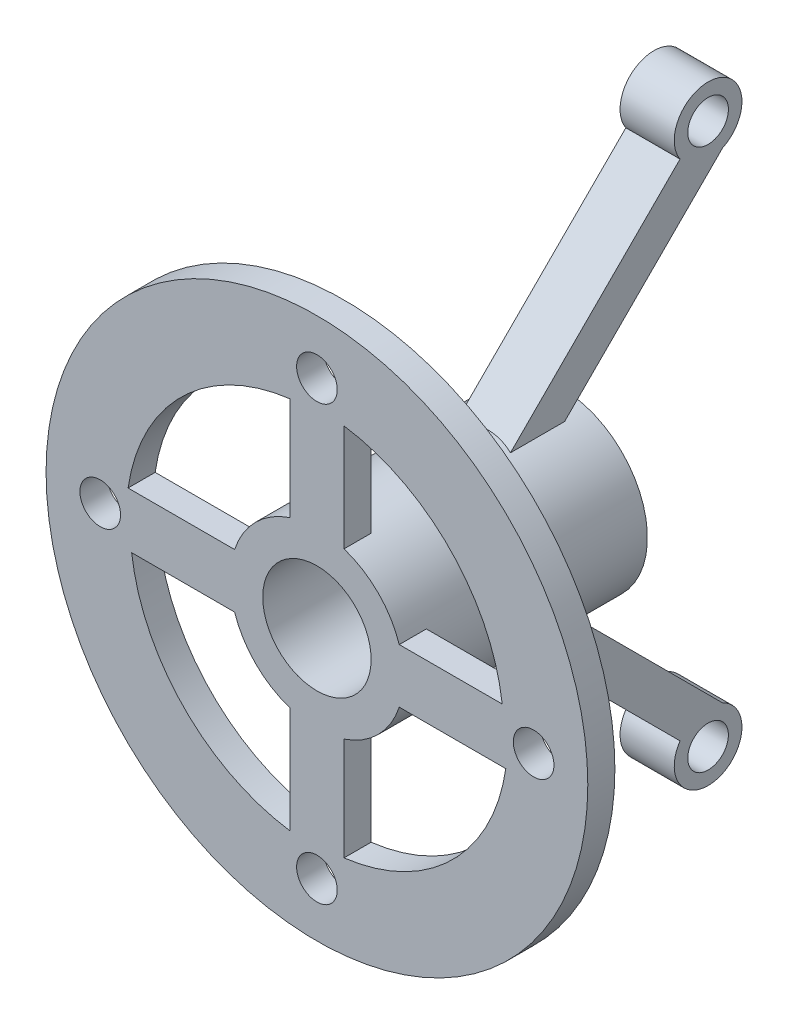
from build123d import *

# Parameters (mm, degrees)
SKETCH2_R           = 63.5
BOSS_EXTRUDE1_DEPTH = 3.175
CUT_EXTRUDE1_REACH  = 92.027
SKETCH3_R           = 4.7625
CIRPATTERN1_COUNT   = 4
CUT_EXTRUDE2_REACH  = 92.027
SKETCH5_R           = 12.7
BOSS_EXTRUDE2_START = 50.8
SKETCH6_R           = 20.32
SKETCH6_R_2         = 12.7
BOSS_EXTRUDE2_DEPTH = 50.8
BOSS_EXTRUDE3_DEPTH = 6.35
SKETCH8_R           = 7.9375
BOSS_EXTRUDE4_DEPTH = 6.35
CUT_EXTRUDE3_REACH  = 136.545
SKETCH9_R           = 4.7625


with BuildPart() as part:
    # Sketch2 → Boss-Extrude1 (new, symmetric)
    with BuildSketch(Plane.XY):
        Circle(SKETCH2_R)
    extrude(amount=BOSS_EXTRUDE1_DEPTH, both=True)

    # Sketch3 → Cut-Extrude1 (cut, up to next)
    with BuildSketch(Plane.XY.offset(3.175), mode=Mode.PRIVATE) as cut_extrude1_sk1:
        with Locations((0, 50.8)):
            Circle(SKETCH3_R)
    cut_extrude1_tool1 = extrude(cut_extrude1_sk1.sketch, amount=-CUT_EXTRUDE1_REACH, mode=Mode.PRIVATE) & part.part
    cut_extrude1 = cut_extrude1_tool1.solids().sort_by_distance((0, 50.8, 3.175))[0]
    add(cut_extrude1, mode=Mode.SUBTRACT)

    # CirPattern1: Cut-Extrude1 ×4 about axis
    cirpattern1_axis = Axis((0, 0, 0), (0, 0, 1))
    for i in range(1, CIRPATTERN1_COUNT):
        add(cut_extrude1.rotate(cirpattern1_axis, i * 360 / CIRPATTERN1_COUNT), mode=Mode.SUBTRACT)

    # Sketch5 → Cut-Extrude2 (cut, up to next)
    with BuildSketch(Plane(origin=(0, 0, -3.175), x_dir=(-1, 0, 0), z_dir=(0, 0, -1)), mode=Mode.PRIVATE) as cut_extrude2_sk1:
        Circle(SKETCH5_R)
    cut_extrude2_tool1 = extrude(cut_extrude2_sk1.sketch, amount=-CUT_EXTRUDE2_REACH, mode=Mode.PRIVATE) & part.part
    # Sketch5 → Cut-Extrude2 (cut, up to next)
    with BuildSketch(Plane(origin=(0, 0, -3.175), x_dir=(-1, 0, 0), z_dir=(0, 0, -1)), mode=Mode.PRIVATE) as cut_extrude2_sk2:
        with BuildLine():
            Line((-19.302328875, 6.35), (-43.432328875, 6.35))
            ThreePointArc((-43.432328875, 6.35), (-31.291126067, 31.57004798), (-6.35, 44.274372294))
            Line((-6.35, 44.274372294), (-6.35, 19.302328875))
            ThreePointArc((-6.35, 19.302328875), (-14.368409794, 14.368409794), (-19.302328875, 6.35))
        make_face()
    cut_extrude2_tool2 = extrude(cut_extrude2_sk2.sketch, amount=-CUT_EXTRUDE2_REACH, mode=Mode.PRIVATE) & part.part
    # Sketch5 → Cut-Extrude2 (cut, up to next)
    with BuildSketch(Plane(origin=(0, 0, -3.175), x_dir=(-1, 0, 0), z_dir=(0, 0, -1)), mode=Mode.PRIVATE) as cut_extrude2_sk3:
        with BuildLine():
            Line((6.35, 19.302328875), (6.35, 43.432328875))
            ThreePointArc((6.35, 43.432328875), (31.57004798, 31.291126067), (44.274372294, 6.35))
            Line((44.274372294, 6.35), (19.302328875, 6.35))
            ThreePointArc((19.302328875, 6.35), (14.368409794, 14.368409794), (6.35, 19.302328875))
        make_face()
    cut_extrude2_tool3 = extrude(cut_extrude2_sk3.sketch, amount=-CUT_EXTRUDE2_REACH, mode=Mode.PRIVATE) & part.part
    # Sketch5 → Cut-Extrude2 (cut, up to next)
    with BuildSketch(Plane(origin=(0, 0, -3.175), x_dir=(-1, 0, 0), z_dir=(0, 0, -1)), mode=Mode.PRIVATE) as cut_extrude2_sk4:
        with BuildLine():
            Line((19.302328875, -6.35), (43.432328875, -6.35))
            ThreePointArc((43.432328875, -6.35), (31.291126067, -31.57004798), (6.35, -44.274372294))
            Line((6.35, -44.274372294), (6.35, -19.302328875))
            ThreePointArc((6.35, -19.302328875), (14.368409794, -14.368409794), (19.302328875, -6.35))
        make_face()
    cut_extrude2_tool4 = extrude(cut_extrude2_sk4.sketch, amount=-CUT_EXTRUDE2_REACH, mode=Mode.PRIVATE) & part.part
    # Sketch5 → Cut-Extrude2 (cut, up to next)
    with BuildSketch(Plane(origin=(0, 0, -3.175), x_dir=(-1, 0, 0), z_dir=(0, 0, -1)), mode=Mode.PRIVATE) as cut_extrude2_sk5:
        with BuildLine():
            Line((-6.35, -19.302328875), (-6.35, -43.432328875))
            ThreePointArc((-6.35, -43.432328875), (-31.57004798, -31.291126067), (-44.274372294, -6.35))
            Line((-44.274372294, -6.35), (-19.302328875, -6.35))
            ThreePointArc((-19.302328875, -6.35), (-14.368409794, -14.368409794), (-6.35, -19.302328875))
        make_face()
    cut_extrude2_tool5 = extrude(cut_extrude2_sk5.sketch, amount=-CUT_EXTRUDE2_REACH, mode=Mode.PRIVATE) & part.part
    add(cut_extrude2_tool1.solids().sort_by_distance((0, 0, -3.175))[0], mode=Mode.SUBTRACT)
    add(cut_extrude2_tool2.solids().sort_by_distance((22.698615, 23.042568, -3.175))[0], mode=Mode.SUBTRACT)
    add(cut_extrude2_tool3.solids().sort_by_distance((-23.042568, 22.698615, -3.175))[0], mode=Mode.SUBTRACT)
    add(cut_extrude2_tool4.solids().sort_by_distance((-22.698615, -23.042568, -3.175))[0], mode=Mode.SUBTRACT)
    add(cut_extrude2_tool5.solids().sort_by_distance((23.042568, -22.698615, -3.175))[0], mode=Mode.SUBTRACT)

    # Sketch6 → Boss-Extrude2 (add)
    with BuildSketch(Plane(origin=(0, 0, -3.175), x_dir=(-1, 0, 0), z_dir=(0, 0, -1)).offset(BOSS_EXTRUDE2_START)):
        Circle(SKETCH6_R)
        Circle(SKETCH6_R_2, mode=Mode.SUBTRACT)
    extrude(amount=-BOSS_EXTRUDE2_DEPTH)

    # Sketch7 → Boss-Extrude3 (add, symmetric)
    with BuildSketch(Plane(origin=(0, 0, 0), x_dir=(0, 0, -1), z_dir=(1, 0, 0))):
        Polygon((31.75, 15.210672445), (44.45, 15.210672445), (89.351280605, 60.11195305), (76.651280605, 60.11195305), align=None)
        Polygon((89.351280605, -60.11195305), (76.651280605, -60.11195305), (31.75, -15.210672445), (44.45, -15.210672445), align=None)
    extrude(amount=BOSS_EXTRUDE3_DEPTH, both=True)

    # Sketch8 → Boss-Extrude4 (add, symmetric)
    with BuildSketch(Plane(origin=(0, 0, 0), x_dir=(0, 0, -1), z_dir=(1, 0, 0))):
        with Locations((82.173185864, 63.5)):
            Circle(SKETCH8_R)
        with Locations((82.173185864, -63.5)):
            Circle(SKETCH8_R)
    extrude(amount=BOSS_EXTRUDE4_DEPTH, both=True)

    # Sketch9 → Cut-Extrude3 (cut, up to next)
    with BuildSketch(Plane(origin=(6.35, 0, 0), x_dir=(0, 0, -1), z_dir=(1, 0, 0)), mode=Mode.PRIVATE) as cut_extrude3_sk1:
        with Locations((82.173185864, 63.5)):
            Circle(SKETCH9_R)
    cut_extrude3_tool1 = extrude(cut_extrude3_sk1.sketch, amount=-CUT_EXTRUDE3_REACH, mode=Mode.PRIVATE) & part.part
    # Sketch9 → Cut-Extrude3 (cut, up to next)
    with BuildSketch(Plane(origin=(6.35, 0, 0), x_dir=(0, 0, -1), z_dir=(1, 0, 0)), mode=Mode.PRIVATE) as cut_extrude3_sk2:
        with Locations(Location((82.173185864, -63.5, 0), (0, 0, 180))):
            Circle(SKETCH9_R)
    cut_extrude3_tool2 = extrude(cut_extrude3_sk2.sketch, amount=-CUT_EXTRUDE3_REACH, mode=Mode.PRIVATE) & part.part
    add(cut_extrude3_tool1.solids().sort_by_distance((6.35, 63.5, -82.173186))[0], mode=Mode.SUBTRACT)
    add(cut_extrude3_tool2.solids().sort_by_distance((6.35, -63.5, -82.173186))[0], mode=Mode.SUBTRACT)


solid = part.part
